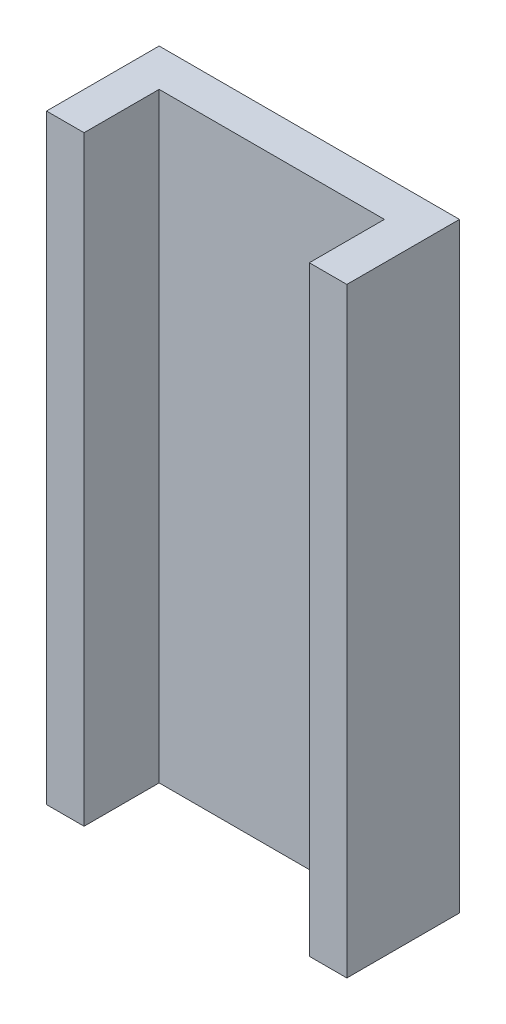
ISO-10303-21;
HEADER;
FILE_DESCRIPTION(('STEP AP214'),'2;1');
FILE_NAME('part.step','',(''),(''),'','','');
FILE_SCHEMA(('AUTOMOTIVE_DESIGN { 1 0 10303 214 1 1 1 1 }'));
ENDSEC;
DATA;
#1=APPLICATION_CONTEXT('core data for automotive mechanical design processes');
#2=APPLICATION_PROTOCOL_DEFINITION('international standard','automotive_design',2000,#1);
#3=PRODUCT_CONTEXT('',#1,'mechanical');
#4=PRODUCT('Part','Part','',(#3));
#5=PRODUCT_RELATED_PRODUCT_CATEGORY('part','',(#4));
#6=PRODUCT_DEFINITION_FORMATION('','',#4);
#7=PRODUCT_DEFINITION_CONTEXT('part definition',#1,'design');
#8=PRODUCT_DEFINITION('design','',#6,#7);
#9=PRODUCT_DEFINITION_SHAPE('','',#8);
#10=(LENGTH_UNIT() NAMED_UNIT(*) SI_UNIT(.MILLI.,.METRE.));
#11=(NAMED_UNIT(*) PLANE_ANGLE_UNIT() SI_UNIT($,.RADIAN.));
#12=(NAMED_UNIT(*) SI_UNIT($,.STERADIAN.) SOLID_ANGLE_UNIT());
#13=UNCERTAINTY_MEASURE_WITH_UNIT(LENGTH_MEASURE(1.E-05),#10,'distance_accuracy_value','');
#14=(GEOMETRIC_REPRESENTATION_CONTEXT(3) GLOBAL_UNCERTAINTY_ASSIGNED_CONTEXT((#13)) GLOBAL_UNIT_ASSIGNED_CONTEXT((#10,
#11,#12)) REPRESENTATION_CONTEXT('',''));
#15=CARTESIAN_POINT('',(0.,0.,0.));
#16=DIRECTION('',(0.,0.,1.));
#17=DIRECTION('',(1.,0.,0.));
#18=AXIS2_PLACEMENT_3D('',#15,#16,#17);
#19=CARTESIAN_POINT('',(-19.05,101.6,12.7));
#20=DIRECTION('',(-1.,0.,0.));
#21=DIRECTION('',(0.,0.,1.));
#22=AXIS2_PLACEMENT_3D('',#19,#20,#21);
#23=PLANE('',#22);
#24=DIRECTION('',(0.,0.,-1.));
#25=VECTOR('',#24,1.);
#26=CARTESIAN_POINT('',(-19.05,0.,12.7));
#27=LINE('',#26,#25);
#28=CARTESIAN_POINT('',(-19.05,0.,12.7));
#29=VERTEX_POINT('',#28);
#30=CARTESIAN_POINT('',(-19.05,0.,0.));
#31=VERTEX_POINT('',#30);
#32=EDGE_CURVE('E140',#29,#31,#27,.T.);
#33=ORIENTED_EDGE('',*,*,#32,.T.);
#34=DIRECTION('',(0.,-1.,0.));
#35=VECTOR('',#34,1.);
#36=CARTESIAN_POINT('',(-19.05,101.6,0.));
#37=LINE('',#36,#35);
#38=CARTESIAN_POINT('',(-19.05,101.6,0.));
#39=VERTEX_POINT('',#38);
#40=EDGE_CURVE('E11',#39,#31,#37,.T.);
#41=ORIENTED_EDGE('',*,*,#40,.F.);
#42=DIRECTION('',(0.,0.,-1.));
#43=VECTOR('',#42,1.);
#44=CARTESIAN_POINT('',(-19.05,101.6,12.7));
#45=LINE('',#44,#43);
#46=CARTESIAN_POINT('',(-19.05,101.6,12.7));
#47=VERTEX_POINT('',#46);
#48=EDGE_CURVE('E162',#47,#39,#45,.T.);
#49=ORIENTED_EDGE('',*,*,#48,.F.);
#50=DIRECTION('',(0.,-1.,0.));
#51=VECTOR('',#50,1.);
#52=CARTESIAN_POINT('',(-19.05,101.6,12.7));
#53=LINE('',#52,#51);
#54=EDGE_CURVE('E136',#47,#29,#53,.T.);
#55=ORIENTED_EDGE('',*,*,#54,.T.);
#56=EDGE_LOOP('',(#33,#41,#49,#55));
#57=FACE_BOUND('',#56,.T.);
#58=ADVANCED_FACE('F39',(#57),#23,.F.);
#59=CARTESIAN_POINT('',(-19.05,101.6,0.));
#60=DIRECTION('',(0.,0.,-1.));
#61=DIRECTION('',(-1.,0.,0.));
#62=AXIS2_PLACEMENT_3D('',#59,#60,#61);
#63=PLANE('',#62);
#64=DIRECTION('',(1.,0.,0.));
#65=VECTOR('',#64,1.);
#66=CARTESIAN_POINT('',(-19.05,0.,0.));
#67=LINE('',#66,#65);
#68=CARTESIAN_POINT('',(19.05,0.,0.));
#69=VERTEX_POINT('',#68);
#70=EDGE_CURVE('E144',#31,#69,#67,.T.);
#71=ORIENTED_EDGE('',*,*,#70,.T.);
#72=DIRECTION('',(0.,-1.,0.));
#73=VECTOR('',#72,1.);
#74=CARTESIAN_POINT('',(19.05,101.6,0.));
#75=LINE('',#74,#73);
#76=CARTESIAN_POINT('',(19.05,101.6,0.));
#77=VERTEX_POINT('',#76);
#78=EDGE_CURVE('E48',#77,#69,#75,.T.);
#79=ORIENTED_EDGE('',*,*,#78,.F.);
#80=DIRECTION('',(1.,0.,0.));
#81=VECTOR('',#80,1.);
#82=CARTESIAN_POINT('',(-19.05,101.6,0.));
#83=LINE('',#82,#81);
#84=EDGE_CURVE('E99',#39,#77,#83,.T.);
#85=ORIENTED_EDGE('',*,*,#84,.F.);
#86=ORIENTED_EDGE('',*,*,#40,.T.);
#87=EDGE_LOOP('',(#71,#79,#85,#86));
#88=FACE_BOUND('',#87,.T.);
#89=ADVANCED_FACE('F208',(#88),#63,.F.);
#90=CARTESIAN_POINT('',(19.05,101.6,0.));
#91=DIRECTION('',(1.,0.,0.));
#92=DIRECTION('',(0.,0.,-1.));
#93=AXIS2_PLACEMENT_3D('',#90,#91,#92);
#94=PLANE('',#93);
#95=DIRECTION('',(0.,0.,1.));
#96=VECTOR('',#95,1.);
#97=CARTESIAN_POINT('',(19.05,0.,0.));
#98=LINE('',#97,#96);
#99=CARTESIAN_POINT('',(19.05,0.,12.7));
#100=VERTEX_POINT('',#99);
#101=EDGE_CURVE('E147',#69,#100,#98,.T.);
#102=ORIENTED_EDGE('',*,*,#101,.T.);
#103=DIRECTION('',(0.,-1.,0.));
#104=VECTOR('',#103,1.);
#105=CARTESIAN_POINT('',(19.05,101.6,12.7));
#106=LINE('',#105,#104);
#107=CARTESIAN_POINT('',(19.05,101.6,12.7));
#108=VERTEX_POINT('',#107);
#109=EDGE_CURVE('E173',#108,#100,#106,.T.);
#110=ORIENTED_EDGE('',*,*,#109,.F.);
#111=DIRECTION('',(0.,0.,1.));
#112=VECTOR('',#111,1.);
#113=CARTESIAN_POINT('',(19.05,101.6,0.));
#114=LINE('',#113,#112);
#115=EDGE_CURVE('E183',#77,#108,#114,.T.);
#116=ORIENTED_EDGE('',*,*,#115,.F.);
#117=ORIENTED_EDGE('',*,*,#78,.T.);
#118=EDGE_LOOP('',(#102,#110,#116,#117));
#119=FACE_BOUND('',#118,.T.);
#120=ADVANCED_FACE('F181',(#119),#94,.F.);
#121=CARTESIAN_POINT('',(19.05,101.6,12.7));
#122=DIRECTION('',(0.,0.,-1.));
#123=DIRECTION('',(-1.,0.,0.));
#124=AXIS2_PLACEMENT_3D('',#121,#122,#123);
#125=PLANE('',#124);
#126=DIRECTION('',(1.,0.,0.));
#127=VECTOR('',#126,1.);
#128=CARTESIAN_POINT('',(19.05,0.,12.7));
#129=LINE('',#128,#127);
#130=CARTESIAN_POINT('',(25.4,0.,12.7));
#131=VERTEX_POINT('',#130);
#132=EDGE_CURVE('E150',#100,#131,#129,.T.);
#133=ORIENTED_EDGE('',*,*,#132,.T.);
#134=DIRECTION('',(0.,-1.,0.));
#135=VECTOR('',#134,1.);
#136=CARTESIAN_POINT('',(25.4,101.6,12.7));
#137=LINE('',#136,#135);
#138=CARTESIAN_POINT('',(25.4,101.6,12.7));
#139=VERTEX_POINT('',#138);
#140=EDGE_CURVE('E169',#139,#131,#137,.T.);
#141=ORIENTED_EDGE('',*,*,#140,.F.);
#142=DIRECTION('',(1.,0.,0.));
#143=VECTOR('',#142,1.);
#144=CARTESIAN_POINT('',(19.05,101.6,12.7));
#145=LINE('',#144,#143);
#146=EDGE_CURVE('E196',#108,#139,#145,.T.);
#147=ORIENTED_EDGE('',*,*,#146,.F.);
#148=ORIENTED_EDGE('',*,*,#109,.T.);
#149=EDGE_LOOP('',(#133,#141,#147,#148));
#150=FACE_BOUND('',#149,.T.);
#151=ADVANCED_FACE('F191',(#150),#125,.F.);
#152=CARTESIAN_POINT('',(25.4,101.6,12.7));
#153=DIRECTION('',(-1.,0.,0.));
#154=DIRECTION('',(0.,0.,1.));
#155=AXIS2_PLACEMENT_3D('',#152,#153,#154);
#156=PLANE('',#155);
#157=DIRECTION('',(0.,0.,-1.));
#158=VECTOR('',#157,1.);
#159=CARTESIAN_POINT('',(25.4,0.,12.7));
#160=LINE('',#159,#158);
#161=CARTESIAN_POINT('',(25.4,0.,-6.35000000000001));
#162=VERTEX_POINT('',#161);
#163=EDGE_CURVE('E153',#131,#162,#160,.T.);
#164=ORIENTED_EDGE('',*,*,#163,.T.);
#165=DIRECTION('',(0.,-1.,0.));
#166=VECTOR('',#165,1.);
#167=CARTESIAN_POINT('',(25.4,101.6,-6.35000000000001));
#168=LINE('',#167,#166);
#169=CARTESIAN_POINT('',(25.4,101.6,-6.35000000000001));
#170=VERTEX_POINT('',#169);
#171=EDGE_CURVE('E129',#170,#162,#168,.T.);
#172=ORIENTED_EDGE('',*,*,#171,.F.);
#173=DIRECTION('',(0.,0.,-1.));
#174=VECTOR('',#173,1.);
#175=CARTESIAN_POINT('',(25.4,101.6,12.7));
#176=LINE('',#175,#174);
#177=EDGE_CURVE('E118',#139,#170,#176,.T.);
#178=ORIENTED_EDGE('',*,*,#177,.F.);
#179=ORIENTED_EDGE('',*,*,#140,.T.);
#180=EDGE_LOOP('',(#164,#172,#178,#179));
#181=FACE_BOUND('',#180,.T.);
#182=ADVANCED_FACE('F194',(#181),#156,.F.);
#183=CARTESIAN_POINT('',(25.4,101.6,-6.35000000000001));
#184=DIRECTION('',(0.,0.,1.));
#185=DIRECTION('',(1.,0.,0.));
#186=AXIS2_PLACEMENT_3D('',#183,#184,#185);
#187=PLANE('',#186);
#188=DIRECTION('',(-1.,0.,0.));
#189=VECTOR('',#188,1.);
#190=CARTESIAN_POINT('',(25.4,0.,-6.35000000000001));
#191=LINE('',#190,#189);
#192=CARTESIAN_POINT('',(-25.4,0.,-6.35));
#193=VERTEX_POINT('',#192);
#194=EDGE_CURVE('E127',#162,#193,#191,.T.);
#195=ORIENTED_EDGE('',*,*,#194,.T.);
#196=DIRECTION('',(0.,-1.,0.));
#197=VECTOR('',#196,1.);
#198=CARTESIAN_POINT('',(-25.4,101.6,-6.35));
#199=LINE('',#198,#197);
#200=CARTESIAN_POINT('',(-25.4,101.6,-6.35));
#201=VERTEX_POINT('',#200);
#202=EDGE_CURVE('E124',#201,#193,#199,.T.);
#203=ORIENTED_EDGE('',*,*,#202,.F.);
#204=DIRECTION('',(-1.,0.,0.));
#205=VECTOR('',#204,1.);
#206=CARTESIAN_POINT('',(25.4,101.6,-6.35000000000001));
#207=LINE('',#206,#205);
#208=EDGE_CURVE('E112',#170,#201,#207,.T.);
#209=ORIENTED_EDGE('',*,*,#208,.F.);
#210=ORIENTED_EDGE('',*,*,#171,.T.);
#211=EDGE_LOOP('',(#195,#203,#209,#210));
#212=FACE_BOUND('',#211,.T.);
#213=ADVANCED_FACE('F125',(#212),#187,.F.);
#214=CARTESIAN_POINT('',(-25.4,101.6,-6.35));
#215=DIRECTION('',(1.,0.,0.));
#216=DIRECTION('',(0.,0.,-1.));
#217=AXIS2_PLACEMENT_3D('',#214,#215,#216);
#218=PLANE('',#217);
#219=DIRECTION('',(0.,0.,1.));
#220=VECTOR('',#219,1.);
#221=CARTESIAN_POINT('',(-25.4,0.,-6.35));
#222=LINE('',#221,#220);
#223=CARTESIAN_POINT('',(-25.4,0.,12.7));
#224=VERTEX_POINT('',#223);
#225=EDGE_CURVE('E85',#193,#224,#222,.T.);
#226=ORIENTED_EDGE('',*,*,#225,.T.);
#227=DIRECTION('',(0.,-1.,0.));
#228=VECTOR('',#227,1.);
#229=CARTESIAN_POINT('',(-25.4,101.6,12.7));
#230=LINE('',#229,#228);
#231=CARTESIAN_POINT('',(-25.4,101.6,12.7));
#232=VERTEX_POINT('',#231);
#233=EDGE_CURVE('E130',#232,#224,#230,.T.);
#234=ORIENTED_EDGE('',*,*,#233,.F.);
#235=DIRECTION('',(0.,0.,1.));
#236=VECTOR('',#235,1.);
#237=CARTESIAN_POINT('',(-25.4,101.6,-6.35));
#238=LINE('',#237,#236);
#239=EDGE_CURVE('E116',#201,#232,#238,.T.);
#240=ORIENTED_EDGE('',*,*,#239,.F.);
#241=ORIENTED_EDGE('',*,*,#202,.T.);
#242=EDGE_LOOP('',(#226,#234,#240,#241));
#243=FACE_BOUND('',#242,.T.);
#244=ADVANCED_FACE('F132',(#243),#218,.F.);
#245=CARTESIAN_POINT('',(-25.4,101.6,12.7));
#246=DIRECTION('',(0.,0.,-1.));
#247=DIRECTION('',(-1.,0.,0.));
#248=AXIS2_PLACEMENT_3D('',#245,#246,#247);
#249=PLANE('',#248);
#250=DIRECTION('',(1.,0.,0.));
#251=VECTOR('',#250,1.);
#252=CARTESIAN_POINT('',(-25.4,0.,12.7));
#253=LINE('',#252,#251);
#254=EDGE_CURVE('E91',#224,#29,#253,.T.);
#255=ORIENTED_EDGE('',*,*,#254,.T.);
#256=ORIENTED_EDGE('',*,*,#54,.F.);
#257=DIRECTION('',(1.,0.,0.));
#258=VECTOR('',#257,1.);
#259=CARTESIAN_POINT('',(-25.4,101.6,12.7));
#260=LINE('',#259,#258);
#261=EDGE_CURVE('E56',#232,#47,#260,.T.);
#262=ORIENTED_EDGE('',*,*,#261,.F.);
#263=ORIENTED_EDGE('',*,*,#233,.T.);
#264=EDGE_LOOP('',(#255,#256,#262,#263));
#265=FACE_BOUND('',#264,.T.);
#266=ADVANCED_FACE('F224',(#265),#249,.F.);
#267=CARTESIAN_POINT('',(0.,101.6,0.));
#268=DIRECTION('',(0.,-1.,0.));
#269=DIRECTION('',(0.,0.,-1.));
#270=AXIS2_PLACEMENT_3D('',#267,#268,#269);
#271=PLANE('',#270);
#272=ORIENTED_EDGE('',*,*,#48,.T.);
#273=ORIENTED_EDGE('',*,*,#84,.T.);
#274=ORIENTED_EDGE('',*,*,#115,.T.);
#275=ORIENTED_EDGE('',*,*,#146,.T.);
#276=ORIENTED_EDGE('',*,*,#177,.T.);
#277=ORIENTED_EDGE('',*,*,#208,.T.);
#278=ORIENTED_EDGE('',*,*,#239,.T.);
#279=ORIENTED_EDGE('',*,*,#261,.T.);
#280=EDGE_LOOP('',(#272,#273,#274,#275,#276,#277,#278,#279));
#281=FACE_BOUND('',#280,.T.);
#282=ADVANCED_FACE('F114',(#281),#271,.F.);
#283=CARTESIAN_POINT('',(0.,0.,0.));
#284=DIRECTION('',(0.,-1.,0.));
#285=DIRECTION('',(0.,0.,-1.));
#286=AXIS2_PLACEMENT_3D('',#283,#284,#285);
#287=PLANE('',#286);
#288=ORIENTED_EDGE('',*,*,#32,.F.);
#289=ORIENTED_EDGE('',*,*,#254,.F.);
#290=ORIENTED_EDGE('',*,*,#225,.F.);
#291=ORIENTED_EDGE('',*,*,#194,.F.);
#292=ORIENTED_EDGE('',*,*,#163,.F.);
#293=ORIENTED_EDGE('',*,*,#132,.F.);
#294=ORIENTED_EDGE('',*,*,#101,.F.);
#295=ORIENTED_EDGE('',*,*,#70,.F.);
#296=EDGE_LOOP('',(#288,#289,#290,#291,#292,#293,#294,#295));
#297=FACE_BOUND('',#296,.T.);
#298=ADVANCED_FACE('F187',(#297),#287,.T.);
#299=CLOSED_SHELL('',(#58,#89,#120,#151,#182,#213,#244,#266,#282,#298));
#300=MANIFOLD_SOLID_BREP('B2',#299);
#301=ADVANCED_BREP_SHAPE_REPRESENTATION('',(#18,#300),#14);
#302=SHAPE_DEFINITION_REPRESENTATION(#9,#301);
ENDSEC;
END-ISO-10303-21;
